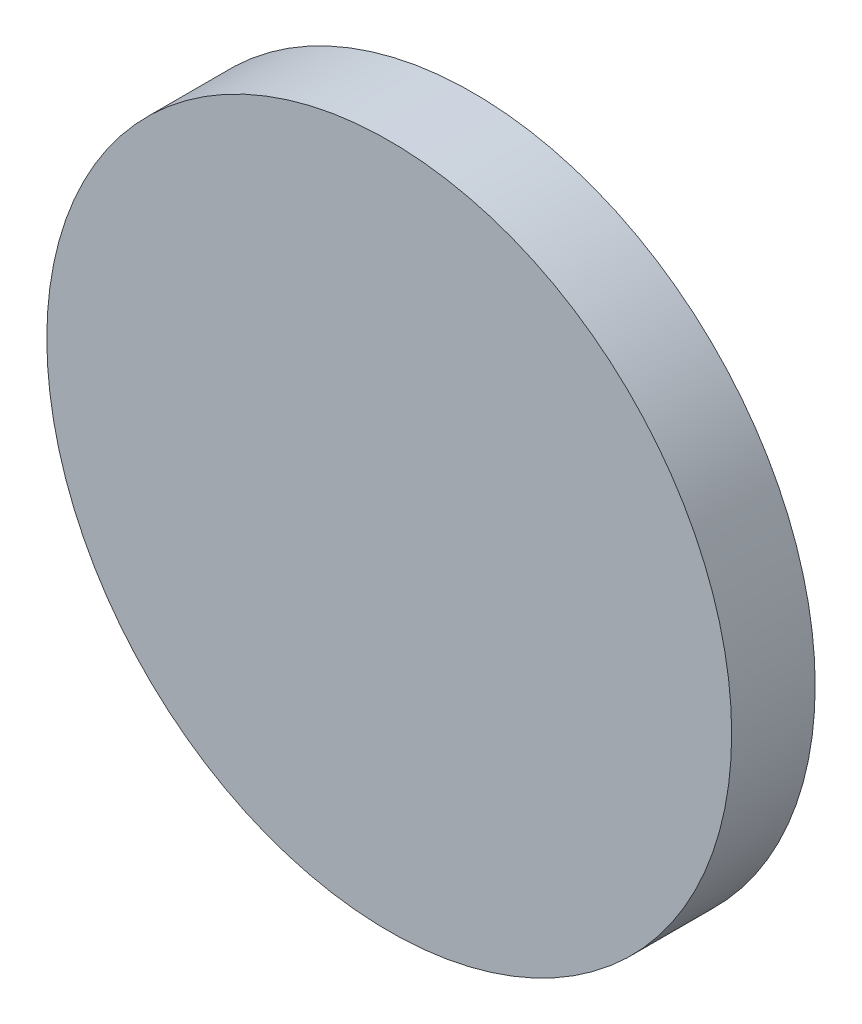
from build123d import *

# Parameters (mm, degrees)
SKETCH1_R      = 20.5
EXTRUDE1_DEPTH = 5


with BuildPart() as part:
    # Sketch1 → Extrude1 (new body)
    with BuildSketch(Plane.XY):
        Circle(SKETCH1_R)
    extrude(amount=EXTRUDE1_DEPTH)


solid = part.part
